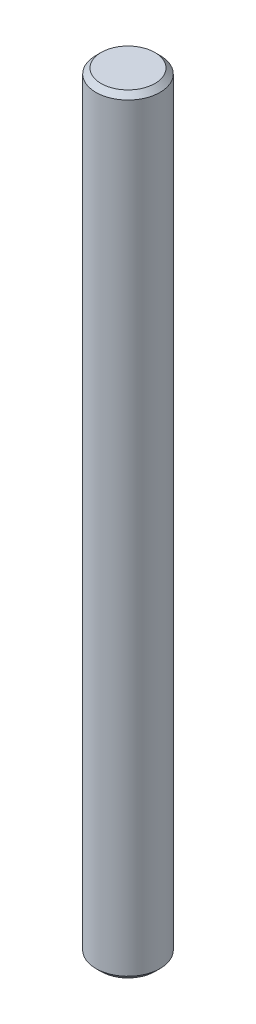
ISO-10303-21;
HEADER;
FILE_DESCRIPTION(('STEP AP214'),'2;1');
FILE_NAME('part.step','',(''),(''),'','','');
FILE_SCHEMA(('AUTOMOTIVE_DESIGN { 1 0 10303 214 1 1 1 1 }'));
ENDSEC;
DATA;
#1=APPLICATION_CONTEXT('core data for automotive mechanical design processes');
#2=APPLICATION_PROTOCOL_DEFINITION('international standard','automotive_design',2000,#1);
#3=PRODUCT_CONTEXT('',#1,'mechanical');
#4=PRODUCT('Part','Part','',(#3));
#5=PRODUCT_RELATED_PRODUCT_CATEGORY('part','',(#4));
#6=PRODUCT_DEFINITION_FORMATION('','',#4);
#7=PRODUCT_DEFINITION_CONTEXT('part definition',#1,'design');
#8=PRODUCT_DEFINITION('design','',#6,#7);
#9=PRODUCT_DEFINITION_SHAPE('','',#8);
#10=(LENGTH_UNIT() NAMED_UNIT(*) SI_UNIT(.MILLI.,.METRE.));
#11=(NAMED_UNIT(*) PLANE_ANGLE_UNIT() SI_UNIT($,.RADIAN.));
#12=(NAMED_UNIT(*) SI_UNIT($,.STERADIAN.) SOLID_ANGLE_UNIT());
#13=UNCERTAINTY_MEASURE_WITH_UNIT(LENGTH_MEASURE(1.E-05),#10,'distance_accuracy_value','');
#14=(GEOMETRIC_REPRESENTATION_CONTEXT(3) GLOBAL_UNCERTAINTY_ASSIGNED_CONTEXT((#13)) GLOBAL_UNIT_ASSIGNED_CONTEXT((#10,
#11,#12)) REPRESENTATION_CONTEXT('',''));
#15=CARTESIAN_POINT('',(0.,0.,0.));
#16=DIRECTION('',(0.,0.,1.));
#17=DIRECTION('',(1.,0.,0.));
#18=AXIS2_PLACEMENT_3D('',#15,#16,#17);
#19=CARTESIAN_POINT('',(0.,60.,0.));
#20=DIRECTION('',(0.,-1.,0.));
#21=DIRECTION('',(0.,0.,-1.));
#22=AXIS2_PLACEMENT_3D('',#19,#20,#21);
#23=CYLINDRICAL_SURFACE('',#22,2.5);
#24=CARTESIAN_POINT('',(0.,0.399999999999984,0.));
#25=DIRECTION('',(0.,1.,0.));
#26=DIRECTION('',(0.,0.,1.));
#27=AXIS2_PLACEMENT_3D('',#24,#25,#26);
#28=CIRCLE('',#27,2.5);
#29=CARTESIAN_POINT('',(0.,0.399999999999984,2.5));
#30=VERTEX_POINT('',#29);
#31=EDGE_CURVE('E40',#30,#30,#28,.T.);
#32=ORIENTED_EDGE('',*,*,#31,.T.);
#33=EDGE_LOOP('',(#32));
#34=FACE_BOUND('',#33,.T.);
#35=CARTESIAN_POINT('',(0.,59.6,0.));
#36=DIRECTION('',(0.,1.,0.));
#37=DIRECTION('',(0.,0.,1.));
#38=AXIS2_PLACEMENT_3D('',#35,#36,#37);
#39=CIRCLE('',#38,2.5);
#40=CARTESIAN_POINT('',(0.,59.6,2.5));
#41=VERTEX_POINT('',#40);
#42=EDGE_CURVE('E44',#41,#41,#39,.F.);
#43=ORIENTED_EDGE('',*,*,#42,.T.);
#44=EDGE_LOOP('',(#43));
#45=FACE_BOUND('',#44,.T.);
#46=ADVANCED_FACE('F30',(#34,#45),#23,.T.);
#47=CARTESIAN_POINT('',(0.,60.,0.));
#48=DIRECTION('',(0.,1.,0.));
#49=DIRECTION('',(0.,0.,1.));
#50=AXIS2_PLACEMENT_3D('',#47,#48,#49);
#51=PLANE('',#50);
#52=CARTESIAN_POINT('',(0.,60.,0.));
#53=DIRECTION('',(0.,1.,0.));
#54=DIRECTION('',(0.,0.,1.));
#55=AXIS2_PLACEMENT_3D('',#52,#53,#54);
#56=CIRCLE('',#55,2.1);
#57=CARTESIAN_POINT('',(0.,60.,2.1));
#58=VERTEX_POINT('',#57);
#59=EDGE_CURVE('E10',#58,#58,#56,.T.);
#60=ORIENTED_EDGE('',*,*,#59,.T.);
#61=EDGE_LOOP('',(#60));
#62=FACE_BOUND('',#61,.T.);
#63=ADVANCED_FACE('F63',(#62),#51,.T.);
#64=CARTESIAN_POINT('',(0.,0.,0.));
#65=DIRECTION('',(0.,1.,0.));
#66=DIRECTION('',(0.,0.,1.));
#67=AXIS2_PLACEMENT_3D('',#64,#65,#66);
#68=PLANE('',#67);
#69=CARTESIAN_POINT('',(0.,0.,0.));
#70=DIRECTION('',(0.,1.,0.));
#71=DIRECTION('',(0.,0.,1.));
#72=AXIS2_PLACEMENT_3D('',#69,#70,#71);
#73=CIRCLE('',#72,2.1);
#74=CARTESIAN_POINT('',(0.,0.,2.1));
#75=VERTEX_POINT('',#74);
#76=EDGE_CURVE('E36',#75,#75,#73,.F.);
#77=ORIENTED_EDGE('',*,*,#76,.T.);
#78=EDGE_LOOP('',(#77));
#79=FACE_BOUND('',#78,.T.);
#80=ADVANCED_FACE('F59',(#79),#68,.F.);
#81=CARTESIAN_POINT('',(0.,0.399999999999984,0.));
#82=DIRECTION('',(0.,1.,0.));
#83=DIRECTION('',(0.,0.,1.));
#84=AXIS2_PLACEMENT_3D('',#81,#82,#83);
#85=CONICAL_SURFACE('',#84,2.5,0.785398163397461);
#86=ORIENTED_EDGE('',*,*,#76,.F.);
#87=EDGE_LOOP('',(#86));
#88=FACE_BOUND('',#87,.T.);
#89=ORIENTED_EDGE('',*,*,#31,.F.);
#90=EDGE_LOOP('',(#89));
#91=FACE_BOUND('',#90,.T.);
#92=ADVANCED_FACE('F54',(#88,#91),#85,.T.);
#93=CARTESIAN_POINT('',(0.,60.,0.));
#94=DIRECTION('',(0.,-1.,0.));
#95=DIRECTION('',(0.,0.,-1.));
#96=AXIS2_PLACEMENT_3D('',#93,#94,#95);
#97=CONICAL_SURFACE('',#96,2.1,0.785398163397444);
#98=ORIENTED_EDGE('',*,*,#42,.F.);
#99=EDGE_LOOP('',(#98));
#100=FACE_BOUND('',#99,.T.);
#101=ORIENTED_EDGE('',*,*,#59,.F.);
#102=EDGE_LOOP('',(#101));
#103=FACE_BOUND('',#102,.T.);
#104=ADVANCED_FACE('F51',(#100,#103),#97,.T.);
#105=CLOSED_SHELL('',(#46,#63,#80,#92,#104));
#106=MANIFOLD_SOLID_BREP('B2',#105);
#107=ADVANCED_BREP_SHAPE_REPRESENTATION('',(#18,#106),#14);
#108=SHAPE_DEFINITION_REPRESENTATION(#9,#107);
ENDSEC;
END-ISO-10303-21;
